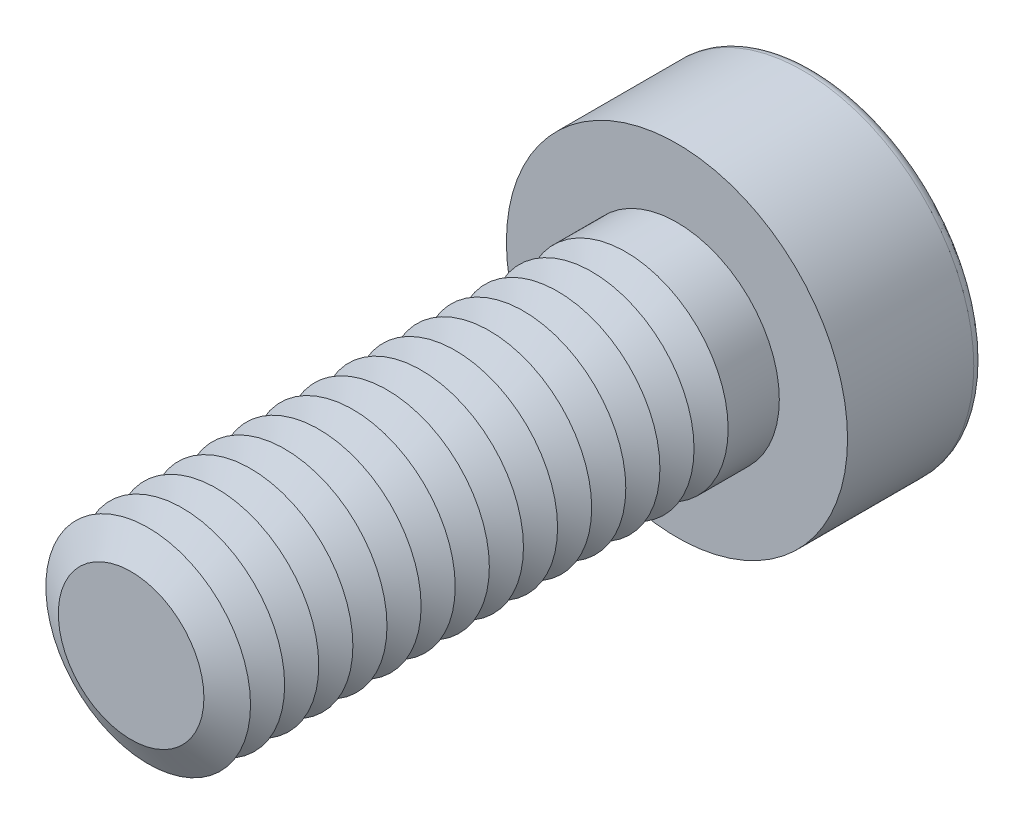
ISO-10303-21;
HEADER;
FILE_DESCRIPTION(('STEP AP214'),'2;1');
FILE_NAME('part.step','',(''),(''),'','','');
FILE_SCHEMA(('AUTOMOTIVE_DESIGN { 1 0 10303 214 1 1 1 1 }'));
ENDSEC;
DATA;
#1=APPLICATION_CONTEXT('core data for automotive mechanical design processes');
#2=APPLICATION_PROTOCOL_DEFINITION('international standard','automotive_design',2000,#1);
#3=PRODUCT_CONTEXT('',#1,'mechanical');
#4=PRODUCT('Part','Part','',(#3));
#5=PRODUCT_RELATED_PRODUCT_CATEGORY('part','',(#4));
#6=PRODUCT_DEFINITION_FORMATION('','',#4);
#7=PRODUCT_DEFINITION_CONTEXT('part definition',#1,'design');
#8=PRODUCT_DEFINITION('design','',#6,#7);
#9=PRODUCT_DEFINITION_SHAPE('','',#8);
#10=(LENGTH_UNIT() NAMED_UNIT(*) SI_UNIT(.MILLI.,.METRE.));
#11=(NAMED_UNIT(*) PLANE_ANGLE_UNIT() SI_UNIT($,.RADIAN.));
#12=(NAMED_UNIT(*) SI_UNIT($,.STERADIAN.) SOLID_ANGLE_UNIT());
#13=UNCERTAINTY_MEASURE_WITH_UNIT(LENGTH_MEASURE(1.E-05),#10,'distance_accuracy_value','');
#14=(GEOMETRIC_REPRESENTATION_CONTEXT(3) GLOBAL_UNCERTAINTY_ASSIGNED_CONTEXT((#13)) GLOBAL_UNIT_ASSIGNED_CONTEXT((#10,
#11,#12)) REPRESENTATION_CONTEXT('',''));
#15=CARTESIAN_POINT('',(0.,0.,0.));
#16=DIRECTION('',(0.,0.,1.));
#17=DIRECTION('',(1.,0.,0.));
#18=AXIS2_PLACEMENT_3D('',#15,#16,#17);
#19=CARTESIAN_POINT('',(0.,0.,12.5));
#20=DIRECTION('',(0.,0.,1.));
#21=DIRECTION('',(1.,0.,0.));
#22=AXIS2_PLACEMENT_3D('',#19,#20,#21);
#23=CONICAL_SURFACE('',#22,3.,1.0471975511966);
#24=CARTESIAN_POINT('',(0.,0.,12.));
#25=DIRECTION('',(0.,0.,1.));
#26=DIRECTION('',(1.,0.,0.));
#27=AXIS2_PLACEMENT_3D('',#24,#25,#26);
#28=CIRCLE('',#27,2.13397459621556);
#29=CARTESIAN_POINT('',(2.13397459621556,0.,12.));
#30=VERTEX_POINT('',#29);
#31=EDGE_CURVE('E313',#30,#30,#28,.T.);
#32=ORIENTED_EDGE('',*,*,#31,.T.);
#33=EDGE_LOOP('',(#32));
#34=FACE_BOUND('',#33,.T.);
#35=CARTESIAN_POINT('',(0.,0.,12.5));
#36=DIRECTION('',(0.,0.,1.));
#37=DIRECTION('',(1.,0.,0.));
#38=AXIS2_PLACEMENT_3D('',#35,#36,#37);
#39=CIRCLE('',#38,3.);
#40=CARTESIAN_POINT('',(3.,0.,12.5));
#41=VERTEX_POINT('',#40);
#42=EDGE_CURVE('E316',#41,#41,#39,.T.);
#43=ORIENTED_EDGE('',*,*,#42,.F.);
#44=EDGE_LOOP('',(#43));
#45=FACE_BOUND('',#44,.T.);
#46=ADVANCED_FACE('F39',(#34,#45),#23,.T.);
#47=CARTESIAN_POINT('',(0.,0.,12.));
#48=DIRECTION('',(0.,0.,-1.));
#49=DIRECTION('',(-1.,0.,0.));
#50=AXIS2_PLACEMENT_3D('',#47,#48,#49);
#51=CONICAL_SURFACE('',#50,2.13397459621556,1.0471975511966);
#52=CARTESIAN_POINT('',(0.,0.,11.5));
#53=DIRECTION('',(0.,0.,1.));
#54=DIRECTION('',(1.,0.,0.));
#55=AXIS2_PLACEMENT_3D('',#52,#53,#54);
#56=CIRCLE('',#55,3.);
#57=CARTESIAN_POINT('',(3.,0.,11.5));
#58=VERTEX_POINT('',#57);
#59=EDGE_CURVE('E323',#58,#58,#56,.T.);
#60=ORIENTED_EDGE('',*,*,#59,.T.);
#61=EDGE_LOOP('',(#60));
#62=FACE_BOUND('',#61,.T.);
#63=ORIENTED_EDGE('',*,*,#31,.F.);
#64=EDGE_LOOP('',(#63));
#65=FACE_BOUND('',#64,.T.);
#66=ADVANCED_FACE('F245',(#62,#65),#51,.T.);
#67=CARTESIAN_POINT('',(0.,0.,16.));
#68=DIRECTION('',(0.,0.,1.));
#69=DIRECTION('',(1.,0.,0.));
#70=AXIS2_PLACEMENT_3D('',#67,#68,#69);
#71=PLANE('',#70);
#72=CARTESIAN_POINT('',(0.,0.,16.));
#73=DIRECTION('',(0.,0.,1.));
#74=DIRECTION('',(1.,0.,0.));
#75=AXIS2_PLACEMENT_3D('',#72,#73,#74);
#76=CIRCLE('',#75,2.13397459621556);
#77=CARTESIAN_POINT('',(2.13397459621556,0.,16.));
#78=VERTEX_POINT('',#77);
#79=EDGE_CURVE('E174',#78,#78,#76,.T.);
#80=ORIENTED_EDGE('',*,*,#79,.T.);
#81=EDGE_LOOP('',(#80));
#82=FACE_BOUND('',#81,.T.);
#83=ADVANCED_FACE('F251',(#82),#71,.T.);
#84=CARTESIAN_POINT('',(0.,0.,16.));
#85=DIRECTION('',(0.,0.,-1.));
#86=DIRECTION('',(-1.,0.,0.));
#87=AXIS2_PLACEMENT_3D('',#84,#85,#86);
#88=CONICAL_SURFACE('',#87,2.13397459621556,1.0471975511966);
#89=CARTESIAN_POINT('',(0.,0.,15.5));
#90=DIRECTION('',(0.,0.,1.));
#91=DIRECTION('',(1.,0.,0.));
#92=AXIS2_PLACEMENT_3D('',#89,#90,#91);
#93=CIRCLE('',#92,3.);
#94=CARTESIAN_POINT('',(3.,0.,15.5));
#95=VERTEX_POINT('',#94);
#96=EDGE_CURVE('E291',#95,#95,#93,.T.);
#97=ORIENTED_EDGE('',*,*,#96,.T.);
#98=EDGE_LOOP('',(#97));
#99=FACE_BOUND('',#98,.T.);
#100=ORIENTED_EDGE('',*,*,#79,.F.);
#101=EDGE_LOOP('',(#100));
#102=FACE_BOUND('',#101,.T.);
#103=ADVANCED_FACE('F199',(#99,#102),#88,.T.);
#104=CARTESIAN_POINT('',(0.,0.,15.5));
#105=DIRECTION('',(0.,0.,1.));
#106=DIRECTION('',(1.,0.,0.));
#107=AXIS2_PLACEMENT_3D('',#104,#105,#106);
#108=CONICAL_SURFACE('',#107,3.,1.0471975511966);
#109=CARTESIAN_POINT('',(0.,0.,15.));
#110=DIRECTION('',(0.,0.,1.));
#111=DIRECTION('',(1.,0.,0.));
#112=AXIS2_PLACEMENT_3D('',#109,#110,#111);
#113=CIRCLE('',#112,2.13397459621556);
#114=CARTESIAN_POINT('',(2.13397459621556,0.,15.));
#115=VERTEX_POINT('',#114);
#116=EDGE_CURVE('E288',#115,#115,#113,.T.);
#117=ORIENTED_EDGE('',*,*,#116,.T.);
#118=EDGE_LOOP('',(#117));
#119=FACE_BOUND('',#118,.T.);
#120=ORIENTED_EDGE('',*,*,#96,.F.);
#121=EDGE_LOOP('',(#120));
#122=FACE_BOUND('',#121,.T.);
#123=ADVANCED_FACE('F277',(#119,#122),#108,.T.);
#124=CARTESIAN_POINT('',(0.,0.,15.));
#125=DIRECTION('',(0.,0.,-1.));
#126=DIRECTION('',(-1.,0.,0.));
#127=AXIS2_PLACEMENT_3D('',#124,#125,#126);
#128=CONICAL_SURFACE('',#127,2.13397459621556,1.0471975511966);
#129=CARTESIAN_POINT('',(0.,0.,14.5));
#130=DIRECTION('',(0.,0.,1.));
#131=DIRECTION('',(1.,0.,0.));
#132=AXIS2_PLACEMENT_3D('',#129,#130,#131);
#133=CIRCLE('',#132,3.);
#134=CARTESIAN_POINT('',(3.,0.,14.5));
#135=VERTEX_POINT('',#134);
#136=EDGE_CURVE('E299',#135,#135,#133,.T.);
#137=ORIENTED_EDGE('',*,*,#136,.T.);
#138=EDGE_LOOP('',(#137));
#139=FACE_BOUND('',#138,.T.);
#140=ORIENTED_EDGE('',*,*,#116,.F.);
#141=EDGE_LOOP('',(#140));
#142=FACE_BOUND('',#141,.T.);
#143=ADVANCED_FACE('F274',(#139,#142),#128,.T.);
#144=CARTESIAN_POINT('',(0.,0.,14.5));
#145=DIRECTION('',(0.,0.,1.));
#146=DIRECTION('',(1.,0.,0.));
#147=AXIS2_PLACEMENT_3D('',#144,#145,#146);
#148=CONICAL_SURFACE('',#147,3.,1.0471975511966);
#149=CARTESIAN_POINT('',(0.,0.,14.));
#150=DIRECTION('',(0.,0.,1.));
#151=DIRECTION('',(1.,0.,0.));
#152=AXIS2_PLACEMENT_3D('',#149,#150,#151);
#153=CIRCLE('',#152,2.13397459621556);
#154=CARTESIAN_POINT('',(2.13397459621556,0.,14.));
#155=VERTEX_POINT('',#154);
#156=EDGE_CURVE('E293',#155,#155,#153,.T.);
#157=ORIENTED_EDGE('',*,*,#156,.T.);
#158=EDGE_LOOP('',(#157));
#159=FACE_BOUND('',#158,.T.);
#160=ORIENTED_EDGE('',*,*,#136,.F.);
#161=EDGE_LOOP('',(#160));
#162=FACE_BOUND('',#161,.T.);
#163=ADVANCED_FACE('F270',(#159,#162),#148,.T.);
#164=CARTESIAN_POINT('',(0.,0.,14.));
#165=DIRECTION('',(0.,0.,-1.));
#166=DIRECTION('',(-1.,0.,0.));
#167=AXIS2_PLACEMENT_3D('',#164,#165,#166);
#168=CONICAL_SURFACE('',#167,2.13397459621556,1.0471975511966);
#169=CARTESIAN_POINT('',(0.,0.,13.5));
#170=DIRECTION('',(0.,0.,1.));
#171=DIRECTION('',(1.,0.,0.));
#172=AXIS2_PLACEMENT_3D('',#169,#170,#171);
#173=CIRCLE('',#172,3.);
#174=CARTESIAN_POINT('',(3.,0.,13.5));
#175=VERTEX_POINT('',#174);
#176=EDGE_CURVE('E309',#175,#175,#173,.T.);
#177=ORIENTED_EDGE('',*,*,#176,.T.);
#178=EDGE_LOOP('',(#177));
#179=FACE_BOUND('',#178,.T.);
#180=ORIENTED_EDGE('',*,*,#156,.F.);
#181=EDGE_LOOP('',(#180));
#182=FACE_BOUND('',#181,.T.);
#183=ADVANCED_FACE('F266',(#179,#182),#168,.T.);
#184=CARTESIAN_POINT('',(0.,0.,13.5));
#185=DIRECTION('',(0.,0.,1.));
#186=DIRECTION('',(1.,0.,0.));
#187=AXIS2_PLACEMENT_3D('',#184,#185,#186);
#188=CONICAL_SURFACE('',#187,3.,1.0471975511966);
#189=CARTESIAN_POINT('',(0.,0.,13.));
#190=DIRECTION('',(0.,0.,1.));
#191=DIRECTION('',(1.,0.,0.));
#192=AXIS2_PLACEMENT_3D('',#189,#190,#191);
#193=CIRCLE('',#192,2.13397459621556);
#194=CARTESIAN_POINT('',(2.13397459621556,0.,13.));
#195=VERTEX_POINT('',#194);
#196=EDGE_CURVE('E305',#195,#195,#193,.T.);
#197=ORIENTED_EDGE('',*,*,#196,.T.);
#198=EDGE_LOOP('',(#197));
#199=FACE_BOUND('',#198,.T.);
#200=ORIENTED_EDGE('',*,*,#176,.F.);
#201=EDGE_LOOP('',(#200));
#202=FACE_BOUND('',#201,.T.);
#203=ADVANCED_FACE('F262',(#199,#202),#188,.T.);
#204=CARTESIAN_POINT('',(0.,0.,13.));
#205=DIRECTION('',(0.,0.,-1.));
#206=DIRECTION('',(-1.,0.,0.));
#207=AXIS2_PLACEMENT_3D('',#204,#205,#206);
#208=CONICAL_SURFACE('',#207,2.13397459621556,1.0471975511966);
#209=ORIENTED_EDGE('',*,*,#42,.T.);
#210=EDGE_LOOP('',(#209));
#211=FACE_BOUND('',#210,.T.);
#212=ORIENTED_EDGE('',*,*,#196,.F.);
#213=EDGE_LOOP('',(#212));
#214=FACE_BOUND('',#213,.T.);
#215=ADVANCED_FACE('F258',(#211,#214),#208,.T.);
#216=CARTESIAN_POINT('',(0.,0.,11.5));
#217=DIRECTION('',(0.,0.,1.));
#218=DIRECTION('',(1.,0.,0.));
#219=AXIS2_PLACEMENT_3D('',#216,#217,#218);
#220=CONICAL_SURFACE('',#219,3.,1.0471975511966);
#221=CARTESIAN_POINT('',(0.,0.,11.));
#222=DIRECTION('',(0.,0.,1.));
#223=DIRECTION('',(1.,0.,0.));
#224=AXIS2_PLACEMENT_3D('',#221,#222,#223);
#225=CIRCLE('',#224,2.13397459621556);
#226=CARTESIAN_POINT('',(2.13397459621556,0.,11.));
#227=VERTEX_POINT('',#226);
#228=EDGE_CURVE('E319',#227,#227,#225,.T.);
#229=ORIENTED_EDGE('',*,*,#228,.T.);
#230=EDGE_LOOP('',(#229));
#231=FACE_BOUND('',#230,.T.);
#232=ORIENTED_EDGE('',*,*,#59,.F.);
#233=EDGE_LOOP('',(#232));
#234=FACE_BOUND('',#233,.T.);
#235=ADVANCED_FACE('F261',(#231,#234),#220,.T.);
#236=CARTESIAN_POINT('',(0.,0.,11.));
#237=DIRECTION('',(0.,0.,-1.));
#238=DIRECTION('',(-1.,0.,0.));
#239=AXIS2_PLACEMENT_3D('',#236,#237,#238);
#240=CONICAL_SURFACE('',#239,2.13397459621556,1.0471975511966);
#241=CARTESIAN_POINT('',(0.,0.,10.5));
#242=DIRECTION('',(0.,0.,1.));
#243=DIRECTION('',(1.,0.,0.));
#244=AXIS2_PLACEMENT_3D('',#241,#242,#243);
#245=CIRCLE('',#244,3.);
#246=CARTESIAN_POINT('',(3.,0.,10.5));
#247=VERTEX_POINT('',#246);
#248=EDGE_CURVE('E331',#247,#247,#245,.T.);
#249=ORIENTED_EDGE('',*,*,#248,.T.);
#250=EDGE_LOOP('',(#249));
#251=FACE_BOUND('',#250,.T.);
#252=ORIENTED_EDGE('',*,*,#228,.F.);
#253=EDGE_LOOP('',(#252));
#254=FACE_BOUND('',#253,.T.);
#255=ADVANCED_FACE('F477',(#251,#254),#240,.T.);
#256=CARTESIAN_POINT('',(0.,0.,10.5));
#257=DIRECTION('',(0.,0.,1.));
#258=DIRECTION('',(1.,0.,0.));
#259=AXIS2_PLACEMENT_3D('',#256,#257,#258);
#260=CONICAL_SURFACE('',#259,3.,1.0471975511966);
#261=CARTESIAN_POINT('',(0.,0.,10.));
#262=DIRECTION('',(0.,0.,1.));
#263=DIRECTION('',(1.,0.,0.));
#264=AXIS2_PLACEMENT_3D('',#261,#262,#263);
#265=CIRCLE('',#264,2.13397459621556);
#266=CARTESIAN_POINT('',(2.13397459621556,0.,10.));
#267=VERTEX_POINT('',#266);
#268=EDGE_CURVE('E327',#267,#267,#265,.T.);
#269=ORIENTED_EDGE('',*,*,#268,.T.);
#270=EDGE_LOOP('',(#269));
#271=FACE_BOUND('',#270,.T.);
#272=ORIENTED_EDGE('',*,*,#248,.F.);
#273=EDGE_LOOP('',(#272));
#274=FACE_BOUND('',#273,.T.);
#275=ADVANCED_FACE('F473',(#271,#274),#260,.T.);
#276=CARTESIAN_POINT('',(0.,0.,10.));
#277=DIRECTION('',(0.,0.,-1.));
#278=DIRECTION('',(-1.,0.,0.));
#279=AXIS2_PLACEMENT_3D('',#276,#277,#278);
#280=CONICAL_SURFACE('',#279,2.13397459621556,1.0471975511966);
#281=CARTESIAN_POINT('',(0.,0.,9.5));
#282=DIRECTION('',(0.,0.,1.));
#283=DIRECTION('',(1.,0.,0.));
#284=AXIS2_PLACEMENT_3D('',#281,#282,#283);
#285=CIRCLE('',#284,3.);
#286=CARTESIAN_POINT('',(3.,0.,9.5));
#287=VERTEX_POINT('',#286);
#288=EDGE_CURVE('E339',#287,#287,#285,.T.);
#289=ORIENTED_EDGE('',*,*,#288,.T.);
#290=EDGE_LOOP('',(#289));
#291=FACE_BOUND('',#290,.T.);
#292=ORIENTED_EDGE('',*,*,#268,.F.);
#293=EDGE_LOOP('',(#292));
#294=FACE_BOUND('',#293,.T.);
#295=ADVANCED_FACE('F469',(#291,#294),#280,.T.);
#296=CARTESIAN_POINT('',(0.,0.,9.5));
#297=DIRECTION('',(0.,0.,1.));
#298=DIRECTION('',(1.,0.,0.));
#299=AXIS2_PLACEMENT_3D('',#296,#297,#298);
#300=CONICAL_SURFACE('',#299,3.,1.0471975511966);
#301=CARTESIAN_POINT('',(0.,0.,9.));
#302=DIRECTION('',(0.,0.,1.));
#303=DIRECTION('',(1.,0.,0.));
#304=AXIS2_PLACEMENT_3D('',#301,#302,#303);
#305=CIRCLE('',#304,2.13397459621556);
#306=CARTESIAN_POINT('',(2.13397459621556,0.,9.));
#307=VERTEX_POINT('',#306);
#308=EDGE_CURVE('E335',#307,#307,#305,.T.);
#309=ORIENTED_EDGE('',*,*,#308,.T.);
#310=EDGE_LOOP('',(#309));
#311=FACE_BOUND('',#310,.T.);
#312=ORIENTED_EDGE('',*,*,#288,.F.);
#313=EDGE_LOOP('',(#312));
#314=FACE_BOUND('',#313,.T.);
#315=ADVANCED_FACE('F465',(#311,#314),#300,.T.);
#316=CARTESIAN_POINT('',(0.,0.,9.));
#317=DIRECTION('',(0.,0.,-1.));
#318=DIRECTION('',(-1.,0.,0.));
#319=AXIS2_PLACEMENT_3D('',#316,#317,#318);
#320=CONICAL_SURFACE('',#319,2.13397459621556,1.0471975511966);
#321=CARTESIAN_POINT('',(0.,0.,8.5));
#322=DIRECTION('',(0.,0.,1.));
#323=DIRECTION('',(1.,0.,0.));
#324=AXIS2_PLACEMENT_3D('',#321,#322,#323);
#325=CIRCLE('',#324,3.);
#326=CARTESIAN_POINT('',(3.,0.,8.5));
#327=VERTEX_POINT('',#326);
#328=EDGE_CURVE('E347',#327,#327,#325,.T.);
#329=ORIENTED_EDGE('',*,*,#328,.T.);
#330=EDGE_LOOP('',(#329));
#331=FACE_BOUND('',#330,.T.);
#332=ORIENTED_EDGE('',*,*,#308,.F.);
#333=EDGE_LOOP('',(#332));
#334=FACE_BOUND('',#333,.T.);
#335=ADVANCED_FACE('F461',(#331,#334),#320,.T.);
#336=CARTESIAN_POINT('',(0.,0.,8.5));
#337=DIRECTION('',(0.,0.,1.));
#338=DIRECTION('',(1.,0.,0.));
#339=AXIS2_PLACEMENT_3D('',#336,#337,#338);
#340=CONICAL_SURFACE('',#339,3.,1.0471975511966);
#341=CARTESIAN_POINT('',(0.,0.,8.));
#342=DIRECTION('',(0.,0.,1.));
#343=DIRECTION('',(1.,0.,0.));
#344=AXIS2_PLACEMENT_3D('',#341,#342,#343);
#345=CIRCLE('',#344,2.13397459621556);
#346=CARTESIAN_POINT('',(2.13397459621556,0.,8.));
#347=VERTEX_POINT('',#346);
#348=EDGE_CURVE('E343',#347,#347,#345,.T.);
#349=ORIENTED_EDGE('',*,*,#348,.T.);
#350=EDGE_LOOP('',(#349));
#351=FACE_BOUND('',#350,.T.);
#352=ORIENTED_EDGE('',*,*,#328,.F.);
#353=EDGE_LOOP('',(#352));
#354=FACE_BOUND('',#353,.T.);
#355=ADVANCED_FACE('F457',(#351,#354),#340,.T.);
#356=CARTESIAN_POINT('',(0.,0.,8.));
#357=DIRECTION('',(0.,0.,-1.));
#358=DIRECTION('',(-1.,0.,0.));
#359=AXIS2_PLACEMENT_3D('',#356,#357,#358);
#360=CONICAL_SURFACE('',#359,2.13397459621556,1.0471975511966);
#361=CARTESIAN_POINT('',(0.,0.,7.5));
#362=DIRECTION('',(0.,0.,1.));
#363=DIRECTION('',(1.,0.,0.));
#364=AXIS2_PLACEMENT_3D('',#361,#362,#363);
#365=CIRCLE('',#364,3.);
#366=CARTESIAN_POINT('',(3.,0.,7.5));
#367=VERTEX_POINT('',#366);
#368=EDGE_CURVE('E354',#367,#367,#365,.T.);
#369=ORIENTED_EDGE('',*,*,#368,.T.);
#370=EDGE_LOOP('',(#369));
#371=FACE_BOUND('',#370,.T.);
#372=ORIENTED_EDGE('',*,*,#348,.F.);
#373=EDGE_LOOP('',(#372));
#374=FACE_BOUND('',#373,.T.);
#375=ADVANCED_FACE('F453',(#371,#374),#360,.T.);
#376=CARTESIAN_POINT('',(0.,0.,7.5));
#377=DIRECTION('',(0.,0.,1.));
#378=DIRECTION('',(1.,0.,0.));
#379=AXIS2_PLACEMENT_3D('',#376,#377,#378);
#380=CONICAL_SURFACE('',#379,3.,1.0471975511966);
#381=CARTESIAN_POINT('',(0.,0.,7.));
#382=DIRECTION('',(0.,0.,1.));
#383=DIRECTION('',(1.,0.,0.));
#384=AXIS2_PLACEMENT_3D('',#381,#382,#383);
#385=CIRCLE('',#384,2.13397459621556);
#386=CARTESIAN_POINT('',(2.13397459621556,0.,7.));
#387=VERTEX_POINT('',#386);
#388=EDGE_CURVE('E350',#387,#387,#385,.T.);
#389=ORIENTED_EDGE('',*,*,#388,.T.);
#390=EDGE_LOOP('',(#389));
#391=FACE_BOUND('',#390,.T.);
#392=ORIENTED_EDGE('',*,*,#368,.F.);
#393=EDGE_LOOP('',(#392));
#394=FACE_BOUND('',#393,.T.);
#395=ADVANCED_FACE('F449',(#391,#394),#380,.T.);
#396=CARTESIAN_POINT('',(0.,0.,7.));
#397=DIRECTION('',(0.,0.,-1.));
#398=DIRECTION('',(-1.,0.,0.));
#399=AXIS2_PLACEMENT_3D('',#396,#397,#398);
#400=CONICAL_SURFACE('',#399,2.13397459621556,1.0471975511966);
#401=CARTESIAN_POINT('',(0.,0.,6.5));
#402=DIRECTION('',(0.,0.,1.));
#403=DIRECTION('',(1.,0.,0.));
#404=AXIS2_PLACEMENT_3D('',#401,#402,#403);
#405=CIRCLE('',#404,3.);
#406=CARTESIAN_POINT('',(3.,0.,6.5));
#407=VERTEX_POINT('',#406);
#408=EDGE_CURVE('E362',#407,#407,#405,.T.);
#409=ORIENTED_EDGE('',*,*,#408,.T.);
#410=EDGE_LOOP('',(#409));
#411=FACE_BOUND('',#410,.T.);
#412=ORIENTED_EDGE('',*,*,#388,.F.);
#413=EDGE_LOOP('',(#412));
#414=FACE_BOUND('',#413,.T.);
#415=ADVANCED_FACE('F445',(#411,#414),#400,.T.);
#416=CARTESIAN_POINT('',(0.,0.,6.5));
#417=DIRECTION('',(0.,0.,1.));
#418=DIRECTION('',(1.,0.,0.));
#419=AXIS2_PLACEMENT_3D('',#416,#417,#418);
#420=CONICAL_SURFACE('',#419,3.,1.0471975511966);
#421=CARTESIAN_POINT('',(0.,0.,6.));
#422=DIRECTION('',(0.,0.,1.));
#423=DIRECTION('',(1.,0.,0.));
#424=AXIS2_PLACEMENT_3D('',#421,#422,#423);
#425=CIRCLE('',#424,2.13397459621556);
#426=CARTESIAN_POINT('',(2.13397459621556,0.,6.));
#427=VERTEX_POINT('',#426);
#428=EDGE_CURVE('E358',#427,#427,#425,.T.);
#429=ORIENTED_EDGE('',*,*,#428,.T.);
#430=EDGE_LOOP('',(#429));
#431=FACE_BOUND('',#430,.T.);
#432=ORIENTED_EDGE('',*,*,#408,.F.);
#433=EDGE_LOOP('',(#432));
#434=FACE_BOUND('',#433,.T.);
#435=ADVANCED_FACE('F441',(#431,#434),#420,.T.);
#436=CARTESIAN_POINT('',(0.,0.,6.));
#437=DIRECTION('',(0.,0.,-1.));
#438=DIRECTION('',(-1.,0.,0.));
#439=AXIS2_PLACEMENT_3D('',#436,#437,#438);
#440=CONICAL_SURFACE('',#439,2.13397459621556,1.0471975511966);
#441=CARTESIAN_POINT('',(0.,0.,5.5));
#442=DIRECTION('',(0.,0.,1.));
#443=DIRECTION('',(1.,0.,0.));
#444=AXIS2_PLACEMENT_3D('',#441,#442,#443);
#445=CIRCLE('',#444,3.);
#446=CARTESIAN_POINT('',(3.,0.,5.5));
#447=VERTEX_POINT('',#446);
#448=EDGE_CURVE('E370',#447,#447,#445,.T.);
#449=ORIENTED_EDGE('',*,*,#448,.T.);
#450=EDGE_LOOP('',(#449));
#451=FACE_BOUND('',#450,.T.);
#452=ORIENTED_EDGE('',*,*,#428,.F.);
#453=EDGE_LOOP('',(#452));
#454=FACE_BOUND('',#453,.T.);
#455=ADVANCED_FACE('F437',(#451,#454),#440,.T.);
#456=CARTESIAN_POINT('',(0.,0.,5.5));
#457=DIRECTION('',(0.,0.,1.));
#458=DIRECTION('',(1.,0.,0.));
#459=AXIS2_PLACEMENT_3D('',#456,#457,#458);
#460=CONICAL_SURFACE('',#459,3.,1.0471975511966);
#461=CARTESIAN_POINT('',(0.,0.,5.));
#462=DIRECTION('',(0.,0.,1.));
#463=DIRECTION('',(1.,0.,0.));
#464=AXIS2_PLACEMENT_3D('',#461,#462,#463);
#465=CIRCLE('',#464,2.13397459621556);
#466=CARTESIAN_POINT('',(2.13397459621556,0.,5.));
#467=VERTEX_POINT('',#466);
#468=EDGE_CURVE('E366',#467,#467,#465,.T.);
#469=ORIENTED_EDGE('',*,*,#468,.T.);
#470=EDGE_LOOP('',(#469));
#471=FACE_BOUND('',#470,.T.);
#472=ORIENTED_EDGE('',*,*,#448,.F.);
#473=EDGE_LOOP('',(#472));
#474=FACE_BOUND('',#473,.T.);
#475=ADVANCED_FACE('F433',(#471,#474),#460,.T.);
#476=CARTESIAN_POINT('',(0.,0.,5.));
#477=DIRECTION('',(0.,0.,-1.));
#478=DIRECTION('',(-1.,0.,0.));
#479=AXIS2_PLACEMENT_3D('',#476,#477,#478);
#480=CONICAL_SURFACE('',#479,2.13397459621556,1.0471975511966);
#481=CARTESIAN_POINT('',(0.,0.,4.5));
#482=DIRECTION('',(0.,0.,1.));
#483=DIRECTION('',(1.,0.,0.));
#484=AXIS2_PLACEMENT_3D('',#481,#482,#483);
#485=CIRCLE('',#484,3.);
#486=CARTESIAN_POINT('',(3.,0.,4.5));
#487=VERTEX_POINT('',#486);
#488=EDGE_CURVE('E378',#487,#487,#485,.T.);
#489=ORIENTED_EDGE('',*,*,#488,.T.);
#490=EDGE_LOOP('',(#489));
#491=FACE_BOUND('',#490,.T.);
#492=ORIENTED_EDGE('',*,*,#468,.F.);
#493=EDGE_LOOP('',(#492));
#494=FACE_BOUND('',#493,.T.);
#495=ADVANCED_FACE('F429',(#491,#494),#480,.T.);
#496=CARTESIAN_POINT('',(0.,0.,4.5));
#497=DIRECTION('',(0.,0.,1.));
#498=DIRECTION('',(1.,0.,0.));
#499=AXIS2_PLACEMENT_3D('',#496,#497,#498);
#500=CONICAL_SURFACE('',#499,3.,1.0471975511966);
#501=CARTESIAN_POINT('',(0.,0.,4.));
#502=DIRECTION('',(0.,0.,1.));
#503=DIRECTION('',(1.,0.,0.));
#504=AXIS2_PLACEMENT_3D('',#501,#502,#503);
#505=CIRCLE('',#504,2.13397459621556);
#506=CARTESIAN_POINT('',(2.13397459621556,0.,4.));
#507=VERTEX_POINT('',#506);
#508=EDGE_CURVE('E374',#507,#507,#505,.T.);
#509=ORIENTED_EDGE('',*,*,#508,.T.);
#510=EDGE_LOOP('',(#509));
#511=FACE_BOUND('',#510,.T.);
#512=ORIENTED_EDGE('',*,*,#488,.F.);
#513=EDGE_LOOP('',(#512));
#514=FACE_BOUND('',#513,.T.);
#515=ADVANCED_FACE('F425',(#511,#514),#500,.T.);
#516=CARTESIAN_POINT('',(0.,0.,4.));
#517=DIRECTION('',(0.,0.,-1.));
#518=DIRECTION('',(-1.,0.,0.));
#519=AXIS2_PLACEMENT_3D('',#516,#517,#518);
#520=CONICAL_SURFACE('',#519,2.13397459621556,1.0471975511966);
#521=CARTESIAN_POINT('',(0.,0.,3.5));
#522=DIRECTION('',(0.,0.,1.));
#523=DIRECTION('',(1.,0.,0.));
#524=AXIS2_PLACEMENT_3D('',#521,#522,#523);
#525=CIRCLE('',#524,3.);
#526=CARTESIAN_POINT('',(3.,0.,3.5));
#527=VERTEX_POINT('',#526);
#528=EDGE_CURVE('E386',#527,#527,#525,.T.);
#529=ORIENTED_EDGE('',*,*,#528,.T.);
#530=EDGE_LOOP('',(#529));
#531=FACE_BOUND('',#530,.T.);
#532=ORIENTED_EDGE('',*,*,#508,.F.);
#533=EDGE_LOOP('',(#532));
#534=FACE_BOUND('',#533,.T.);
#535=ADVANCED_FACE('F421',(#531,#534),#520,.T.);
#536=CARTESIAN_POINT('',(0.,0.,3.5));
#537=DIRECTION('',(0.,0.,1.));
#538=DIRECTION('',(1.,0.,0.));
#539=AXIS2_PLACEMENT_3D('',#536,#537,#538);
#540=CONICAL_SURFACE('',#539,3.,1.0471975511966);
#541=CARTESIAN_POINT('',(0.,0.,3.));
#542=DIRECTION('',(0.,0.,1.));
#543=DIRECTION('',(1.,0.,0.));
#544=AXIS2_PLACEMENT_3D('',#541,#542,#543);
#545=CIRCLE('',#544,2.13397459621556);
#546=CARTESIAN_POINT('',(2.13397459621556,0.,3.));
#547=VERTEX_POINT('',#546);
#548=EDGE_CURVE('E382',#547,#547,#545,.T.);
#549=ORIENTED_EDGE('',*,*,#548,.T.);
#550=EDGE_LOOP('',(#549));
#551=FACE_BOUND('',#550,.T.);
#552=ORIENTED_EDGE('',*,*,#528,.F.);
#553=EDGE_LOOP('',(#552));
#554=FACE_BOUND('',#553,.T.);
#555=ADVANCED_FACE('F416',(#551,#554),#540,.T.);
#556=CARTESIAN_POINT('',(0.,0.,3.));
#557=DIRECTION('',(0.,0.,-1.));
#558=DIRECTION('',(-1.,0.,0.));
#559=AXIS2_PLACEMENT_3D('',#556,#557,#558);
#560=CONICAL_SURFACE('',#559,2.13397459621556,1.0471975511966);
#561=CARTESIAN_POINT('',(0.,0.,2.5));
#562=DIRECTION('',(0.,0.,1.));
#563=DIRECTION('',(1.,0.,0.));
#564=AXIS2_PLACEMENT_3D('',#561,#562,#563);
#565=CIRCLE('',#564,3.);
#566=CARTESIAN_POINT('',(3.,0.,2.5));
#567=VERTEX_POINT('',#566);
#568=EDGE_CURVE('E397',#567,#567,#565,.T.);
#569=ORIENTED_EDGE('',*,*,#568,.T.);
#570=EDGE_LOOP('',(#569));
#571=FACE_BOUND('',#570,.T.);
#572=ORIENTED_EDGE('',*,*,#548,.F.);
#573=EDGE_LOOP('',(#572));
#574=FACE_BOUND('',#573,.T.);
#575=ADVANCED_FACE('F402',(#571,#574),#560,.T.);
#576=CARTESIAN_POINT('',(0.,0.,2.5));
#577=DIRECTION('',(0.,0.,1.));
#578=DIRECTION('',(1.,0.,0.));
#579=AXIS2_PLACEMENT_3D('',#576,#577,#578);
#580=CONICAL_SURFACE('',#579,3.,1.0471975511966);
#581=CARTESIAN_POINT('',(0.,0.,2.));
#582=DIRECTION('',(0.,0.,1.));
#583=DIRECTION('',(1.,0.,0.));
#584=AXIS2_PLACEMENT_3D('',#581,#582,#583);
#585=CIRCLE('',#584,2.13397459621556);
#586=CARTESIAN_POINT('',(2.13397459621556,0.,2.));
#587=VERTEX_POINT('',#586);
#588=EDGE_CURVE('E390',#587,#587,#585,.T.);
#589=ORIENTED_EDGE('',*,*,#588,.T.);
#590=EDGE_LOOP('',(#589));
#591=FACE_BOUND('',#590,.T.);
#592=ORIENTED_EDGE('',*,*,#568,.F.);
#593=EDGE_LOOP('',(#592));
#594=FACE_BOUND('',#593,.T.);
#595=ADVANCED_FACE('F405',(#591,#594),#580,.T.);
#596=CARTESIAN_POINT('',(0.,0.,2.));
#597=DIRECTION('',(0.,0.,-1.));
#598=DIRECTION('',(-1.,0.,0.));
#599=AXIS2_PLACEMENT_3D('',#596,#597,#598);
#600=CONICAL_SURFACE('',#599,2.13397459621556,1.0471975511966);
#601=CARTESIAN_POINT('',(0.,0.,1.5));
#602=DIRECTION('',(0.,0.,1.));
#603=DIRECTION('',(1.,0.,0.));
#604=AXIS2_PLACEMENT_3D('',#601,#602,#603);
#605=CIRCLE('',#604,3.);
#606=CARTESIAN_POINT('',(3.,0.,1.5));
#607=VERTEX_POINT('',#606);
#608=EDGE_CURVE('E393',#607,#607,#605,.T.);
#609=ORIENTED_EDGE('',*,*,#608,.T.);
#610=EDGE_LOOP('',(#609));
#611=FACE_BOUND('',#610,.T.);
#612=ORIENTED_EDGE('',*,*,#588,.F.);
#613=EDGE_LOOP('',(#612));
#614=FACE_BOUND('',#613,.T.);
#615=ADVANCED_FACE('F407',(#611,#614),#600,.T.);
#616=CARTESIAN_POINT('',(0.,0.,-1.));
#617=DIRECTION('',(0.,0.,-1.));
#618=DIRECTION('',(-1.,0.,0.));
#619=AXIS2_PLACEMENT_3D('',#616,#617,#618);
#620=CONICAL_SURFACE('',#619,2.,1.0471975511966);
#621=CARTESIAN_POINT('',(0.,0.,0.154700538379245));
#622=VERTEX_POINT('',#621);
#623=VERTEX_LOOP('',#622);
#624=FACE_BOUND('',#623,.T.);
#625=CARTESIAN_POINT('',(0.,0.,-1.));
#626=DIRECTION('',(0.,0.,-1.));
#627=DIRECTION('',(-1.,0.,0.));
#628=AXIS2_PLACEMENT_3D('',#625,#626,#627);
#629=CIRCLE('',#628,2.);
#630=CARTESIAN_POINT('',(-1.73205080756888,0.999999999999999,-1.));
#631=VERTEX_POINT('',#630);
#632=CARTESIAN_POINT('',(0.,2.,-1.));
#633=VERTEX_POINT('',#632);
#634=EDGE_CURVE('E149',#631,#633,#629,.T.);
#635=ORIENTED_EDGE('',*,*,#634,.T.);
#636=CARTESIAN_POINT('',(0.,0.,-1.));
#637=DIRECTION('',(0.,0.,-1.));
#638=DIRECTION('',(-1.,0.,0.));
#639=AXIS2_PLACEMENT_3D('',#636,#637,#638);
#640=CIRCLE('',#639,2.);
#641=CARTESIAN_POINT('',(1.73205080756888,1.,-1.));
#642=VERTEX_POINT('',#641);
#643=EDGE_CURVE('E54',#633,#642,#640,.T.);
#644=ORIENTED_EDGE('',*,*,#643,.T.);
#645=CARTESIAN_POINT('',(1.73205080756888,-0.999999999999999,-1.));
#646=VERTEX_POINT('',#645);
#647=EDGE_CURVE('E964',#642,#646,#640,.T.);
#648=ORIENTED_EDGE('',*,*,#647,.T.);
#649=CARTESIAN_POINT('',(0.,-2.,-1.));
#650=VERTEX_POINT('',#649);
#651=EDGE_CURVE('E962',#646,#650,#640,.T.);
#652=ORIENTED_EDGE('',*,*,#651,.T.);
#653=CARTESIAN_POINT('',(-1.73205080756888,-0.999999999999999,-1.));
#654=VERTEX_POINT('',#653);
#655=EDGE_CURVE('E957',#650,#654,#640,.T.);
#656=ORIENTED_EDGE('',*,*,#655,.T.);
#657=EDGE_CURVE('E955',#654,#631,#640,.T.);
#658=ORIENTED_EDGE('',*,*,#657,.T.);
#659=EDGE_LOOP('',(#635,#644,#648,#652,#656,#658));
#660=FACE_BOUND('',#659,.T.);
#661=ADVANCED_FACE('F201',(#624,#660),#620,.F.);
#662=CARTESIAN_POINT('',(0.,0.,-1.));
#663=DIRECTION('',(0.,0.,-1.));
#664=DIRECTION('',(-1.,0.,0.));
#665=AXIS2_PLACEMENT_3D('',#662,#663,#664);
#666=PLANE('',#665);
#667=ORIENTED_EDGE('',*,*,#643,.F.);
#668=DIRECTION('',(1.,0.,0.));
#669=VECTOR('',#668,1.);
#670=CARTESIAN_POINT('',(-1.15470053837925,2.,-1.));
#671=LINE('',#670,#669);
#672=CARTESIAN_POINT('',(1.15470053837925,2.,-1.));
#673=VERTEX_POINT('',#672);
#674=EDGE_CURVE('E1001',#633,#673,#671,.T.);
#675=ORIENTED_EDGE('',*,*,#674,.T.);
#676=DIRECTION('',(0.5,-0.866025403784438,0.));
#677=VECTOR('',#676,1.);
#678=CARTESIAN_POINT('',(1.15470053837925,2.,-1.));
#679=LINE('',#678,#677);
#680=EDGE_CURVE('E155',#673,#642,#679,.T.);
#681=ORIENTED_EDGE('',*,*,#680,.T.);
#682=EDGE_LOOP('',(#667,#675,#681));
#683=FACE_BOUND('',#682,.T.);
#684=ADVANCED_FACE('F560',(#683),#666,.T.);
#685=ORIENTED_EDGE('',*,*,#647,.F.);
#686=CARTESIAN_POINT('',(2.3094010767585,0.,-1.));
#687=VERTEX_POINT('',#686);
#688=EDGE_CURVE('E1007',#642,#687,#679,.T.);
#689=ORIENTED_EDGE('',*,*,#688,.T.);
#690=DIRECTION('',(-0.5,-0.866025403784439,0.));
#691=VECTOR('',#690,1.);
#692=CARTESIAN_POINT('',(2.3094010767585,0.,-1.));
#693=LINE('',#692,#691);
#694=EDGE_CURVE('E976',#687,#646,#693,.T.);
#695=ORIENTED_EDGE('',*,*,#694,.T.);
#696=EDGE_LOOP('',(#685,#689,#695));
#697=FACE_BOUND('',#696,.T.);
#698=ADVANCED_FACE('F570',(#697),#666,.T.);
#699=ORIENTED_EDGE('',*,*,#651,.F.);
#700=CARTESIAN_POINT('',(1.15470053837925,-2.,-1.));
#701=VERTEX_POINT('',#700);
#702=EDGE_CURVE('E978',#646,#701,#693,.T.);
#703=ORIENTED_EDGE('',*,*,#702,.T.);
#704=DIRECTION('',(-1.,0.,0.));
#705=VECTOR('',#704,1.);
#706=CARTESIAN_POINT('',(1.15470053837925,-2.,-1.));
#707=LINE('',#706,#705);
#708=EDGE_CURVE('E929',#701,#650,#707,.T.);
#709=ORIENTED_EDGE('',*,*,#708,.T.);
#710=EDGE_LOOP('',(#699,#703,#709));
#711=FACE_BOUND('',#710,.T.);
#712=ADVANCED_FACE('F580',(#711),#666,.T.);
#713=ORIENTED_EDGE('',*,*,#655,.F.);
#714=CARTESIAN_POINT('',(-1.15470053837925,-2.,-1.));
#715=VERTEX_POINT('',#714);
#716=EDGE_CURVE('E972',#650,#715,#707,.T.);
#717=ORIENTED_EDGE('',*,*,#716,.T.);
#718=DIRECTION('',(-0.5,0.866025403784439,0.));
#719=VECTOR('',#718,1.);
#720=CARTESIAN_POINT('',(-1.15470053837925,-2.,-1.));
#721=LINE('',#720,#719);
#722=EDGE_CURVE('E974',#715,#654,#721,.T.);
#723=ORIENTED_EDGE('',*,*,#722,.T.);
#724=EDGE_LOOP('',(#713,#717,#723));
#725=FACE_BOUND('',#724,.T.);
#726=ADVANCED_FACE('F588',(#725),#666,.T.);
#727=ORIENTED_EDGE('',*,*,#657,.F.);
#728=CARTESIAN_POINT('',(-2.3094010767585,0.,-1.));
#729=VERTEX_POINT('',#728);
#730=EDGE_CURVE('E980',#654,#729,#721,.T.);
#731=ORIENTED_EDGE('',*,*,#730,.T.);
#732=DIRECTION('',(0.5,0.866025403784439,0.));
#733=VECTOR('',#732,1.);
#734=CARTESIAN_POINT('',(-2.3094010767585,0.,-1.));
#735=LINE('',#734,#733);
#736=EDGE_CURVE('E158',#729,#631,#735,.T.);
#737=ORIENTED_EDGE('',*,*,#736,.T.);
#738=EDGE_LOOP('',(#727,#731,#737));
#739=FACE_BOUND('',#738,.T.);
#740=ADVANCED_FACE('F231',(#739),#666,.T.);
#741=ORIENTED_EDGE('',*,*,#634,.F.);
#742=CARTESIAN_POINT('',(-1.15470053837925,2.,-1.));
#743=VERTEX_POINT('',#742);
#744=EDGE_CURVE('E987',#631,#743,#735,.T.);
#745=ORIENTED_EDGE('',*,*,#744,.T.);
#746=EDGE_CURVE('E1002',#743,#633,#671,.T.);
#747=ORIENTED_EDGE('',*,*,#746,.T.);
#748=EDGE_LOOP('',(#741,#745,#747));
#749=FACE_BOUND('',#748,.T.);
#750=ADVANCED_FACE('F572',(#749),#666,.T.);
#751=CARTESIAN_POINT('',(-1.15470053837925,2.,-1.));
#752=DIRECTION('',(0.,1.,0.));
#753=DIRECTION('',(0.,0.,1.));
#754=AXIS2_PLACEMENT_3D('',#751,#752,#753);
#755=PLANE('',#754);
#756=DIRECTION('',(0.,0.,-1.));
#757=VECTOR('',#756,1.);
#758=CARTESIAN_POINT('',(-1.15470053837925,2.,-1.));
#759=LINE('',#758,#757);
#760=CARTESIAN_POINT('',(-1.15470053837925,2.,-4.));
#761=VERTEX_POINT('',#760);
#762=EDGE_CURVE('E147',#743,#761,#759,.T.);
#763=ORIENTED_EDGE('',*,*,#762,.T.);
#764=CARTESIAN_POINT('',(-3.01440758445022,2.,-4.35051689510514));
#765=CARTESIAN_POINT('',(-2.92409762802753,2.,-4.33035636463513));
#766=CARTESIAN_POINT('',(-2.83373054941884,2.,-4.31045254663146));
#767=CARTESIAN_POINT('',(-2.65285291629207,2.,-4.27128852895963));
#768=CARTESIAN_POINT('',(-2.562342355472,2.,-4.25202835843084));
#769=CARTESIAN_POINT('',(-2.29037985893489,2.,-4.19537300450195));
#770=CARTESIAN_POINT('',(-2.10868043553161,2.,-4.15914446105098));
#771=CARTESIAN_POINT('',(-1.74597297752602,2.,-4.09171688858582));
#772=CARTESIAN_POINT('',(-1.56497266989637,2.,-4.06047686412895));
#773=CARTESIAN_POINT('',(-1.20186568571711,2.,-4.00513826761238));
#774=CARTESIAN_POINT('',(-1.01975924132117,2.,-3.98103824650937));
#775=CARTESIAN_POINT('',(-0.744747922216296,2.,-3.9525901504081));
#776=CARTESIAN_POINT('',(-0.652245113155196,2.,-3.9443671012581));
#777=CARTESIAN_POINT('',(-0.467020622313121,2.,-3.93099406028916));
#778=CARTESIAN_POINT('',(-0.374298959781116,2.,-3.92584380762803));
#779=CARTESIAN_POINT('',(-0.188764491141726,2.,-3.91891540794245));
#780=CARTESIAN_POINT('',(-0.0959517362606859,2.,-3.91713591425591));
#781=CARTESIAN_POINT('',(0.0896753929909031,2.,-3.91705786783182));
#782=CARTESIAN_POINT('',(0.182489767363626,2.,-3.91875932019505));
#783=CARTESIAN_POINT('',(0.368369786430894,2.,-3.92554892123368));
#784=CARTESIAN_POINT('',(0.461434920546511,2.,-3.93065079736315));
#785=CARTESIAN_POINT('',(0.647346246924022,2.,-3.94395663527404));
#786=CARTESIAN_POINT('',(0.740192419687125,2.,-3.95216086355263));
#787=CARTESIAN_POINT('',(1.01841374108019,2.,-3.98081777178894));
#788=CARTESIAN_POINT('',(1.2033713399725,2.,-4.00531018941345));
#789=CARTESIAN_POINT('',(1.57694396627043,2.,-4.06236202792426));
#790=CARTESIAN_POINT('',(1.76552771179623,2.,-4.09511615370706));
#791=CARTESIAN_POINT('',(2.14178491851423,2.,-4.1655706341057));
#792=CARTESIAN_POINT('',(2.32945822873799,2.,-4.20327178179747));
#793=CARTESIAN_POINT('',(2.70417911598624,2.,-4.28188312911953));
#794=CARTESIAN_POINT('',(2.89122649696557,2.,-4.32279425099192));
#795=CARTESIAN_POINT('',(3.26484478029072,2.,-4.40674298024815));
#796=CARTESIAN_POINT('',(3.45141567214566,2.,-4.44978063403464));
#797=CARTESIAN_POINT('',(3.821938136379,2.,-4.53678178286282));
#798=CARTESIAN_POINT('',(4.00589388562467,2.,-4.58072756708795));
#799=CARTESIAN_POINT('',(4.37356350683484,2.,-4.66963526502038));
#800=CARTESIAN_POINT('',(4.55727737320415,2.,-4.71459720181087));
#801=CARTESIAN_POINT('',(4.9242660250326,2.,-4.80519833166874));
#802=CARTESIAN_POINT('',(5.10754106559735,2.,-4.85083649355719));
#803=CARTESIAN_POINT('',(5.47394280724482,2.,-4.94267693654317));
#804=CARTESIAN_POINT('',(5.65706951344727,2.,-4.98887919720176));
#805=CARTESIAN_POINT('',(5.84014583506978,2.,-5.03527803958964));
#806=B_SPLINE_CURVE_WITH_KNOTS('',3,(#764,#765,#766,#767,#768,#769,#770,#771,#772,#773,#774,
#775,#776,#777,#778,#779,#780,#781,#782,#783,#784,#785,#786,#787,#788,#789,#790,#791,#792,#793,
#794,#795,#796,#797,#798,#799,#800,#801,#802,#803,#804,#805),.UNSPECIFIED.,.F.,.F.,(4,2,2,2,2,2,
2,2,2,2,2,2,2,2,2,2,2,2,2,2,4),(0.,0.277597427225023,0.555207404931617,1.11099118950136,
1.66194208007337,2.21278108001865,2.49134108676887,2.76987744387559,3.04830249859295,
3.32672796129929,3.60628428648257,3.88586463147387,4.44532615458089,5.0194589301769,
5.59368385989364,6.16807437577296,6.74247743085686,7.30986991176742,7.87727529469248,
8.44388991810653,9.01048407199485),.UNSPECIFIED.);
#807=CARTESIAN_POINT('',(1.15470053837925,2.,-4.));
#808=VERTEX_POINT('',#807);
#809=EDGE_CURVE('E124',#761,#808,#806,.T.);
#810=ORIENTED_EDGE('',*,*,#809,.T.);
#811=DIRECTION('',(0.,0.,-1.));
#812=VECTOR('',#811,1.);
#813=CARTESIAN_POINT('',(1.15470053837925,2.,-1.));
#814=LINE('',#813,#812);
#815=EDGE_CURVE('E143',#673,#808,#814,.T.);
#816=ORIENTED_EDGE('',*,*,#815,.F.);
#817=ORIENTED_EDGE('',*,*,#674,.F.);
#818=ORIENTED_EDGE('',*,*,#746,.F.);
#819=EDGE_LOOP('',(#763,#810,#816,#817,#818));
#820=FACE_BOUND('',#819,.T.);
#821=ADVANCED_FACE('F141',(#820),#755,.F.);
#822=CARTESIAN_POINT('',(1.15470053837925,2.,-1.));
#823=DIRECTION('',(0.866025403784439,0.5,0.));
#824=DIRECTION('',(-0.5,0.866025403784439,0.));
#825=AXIS2_PLACEMENT_3D('',#822,#823,#824);
#826=PLANE('',#825);
#827=ORIENTED_EDGE('',*,*,#815,.T.);
#828=CARTESIAN_POINT('',(1.15458506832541,2.0002,-4.00003094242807));
#829=CARTESIAN_POINT('',(1.20254643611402,1.91712847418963,-3.98717294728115));
#830=CARTESIAN_POINT('',(1.25059477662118,1.83390630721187,-3.97549990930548));
#831=CARTESIAN_POINT('',(1.3468611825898,1.66716800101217,-3.95499135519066));
#832=CARTESIAN_POINT('',(1.39507930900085,1.58365175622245,-3.94615699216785));
#833=CARTESIAN_POINT('',(1.49139287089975,1.41683177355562,-3.93184164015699));
#834=CARTESIAN_POINT('',(1.53948765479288,1.33352916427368,-3.92634357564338));
#835=CARTESIAN_POINT('',(1.63573857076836,1.1668176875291,-3.91897122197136));
#836=CARTESIAN_POINT('',(1.68389468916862,1.08340884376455,-3.91709623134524));
#837=CARTESIAN_POINT('',(1.78020692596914,0.916591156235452,-3.91709623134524));
#838=CARTESIAN_POINT('',(1.82836304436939,0.833182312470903,-3.91897122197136));
#839=CARTESIAN_POINT('',(1.92461396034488,0.666470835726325,-3.92634357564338));
#840=CARTESIAN_POINT('',(1.972708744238,0.583168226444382,-3.93184164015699));
#841=CARTESIAN_POINT('',(2.06902230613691,0.416348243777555,-3.94615699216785));
#842=CARTESIAN_POINT('',(2.11724043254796,0.332831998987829,-3.95499135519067));
#843=CARTESIAN_POINT('',(2.21350683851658,0.16609369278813,-3.97549990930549));
#844=CARTESIAN_POINT('',(2.26155517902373,0.0828715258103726,-3.98717294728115));
#845=CARTESIAN_POINT('',(2.30951654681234,-0.000199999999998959,-4.00003094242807));
#846=B_SPLINE_CURVE_WITH_KNOTS('',3,(#828,#829,#830,#831,#832,#833,#834,#835,#836,#837,#838,
#839,#840,#841,#842,#843,#844,#845),.UNSPECIFIED.,.F.,.F.,(4,2,2,2,2,2,2,2,4),(0.,
0.29035724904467,0.580832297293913,0.869807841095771,1.15872743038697,1.44764701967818,
1.73662256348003,2.02709761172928,2.31745486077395),.UNSPECIFIED.);
#847=CARTESIAN_POINT('',(2.3094010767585,0.,-4.));
#848=VERTEX_POINT('',#847);
#849=EDGE_CURVE('E11',#808,#848,#846,.T.);
#850=ORIENTED_EDGE('',*,*,#849,.T.);
#851=DIRECTION('',(0.,0.,-1.));
#852=VECTOR('',#851,1.);
#853=CARTESIAN_POINT('',(2.3094010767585,0.,-1.));
#854=LINE('',#853,#852);
#855=EDGE_CURVE('E157',#687,#848,#854,.T.);
#856=ORIENTED_EDGE('',*,*,#855,.F.);
#857=ORIENTED_EDGE('',*,*,#688,.F.);
#858=ORIENTED_EDGE('',*,*,#680,.F.);
#859=EDGE_LOOP('',(#827,#850,#856,#857,#858));
#860=FACE_BOUND('',#859,.T.);
#861=ADVANCED_FACE('F152',(#860),#826,.F.);
#862=CARTESIAN_POINT('',(2.3094010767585,0.,-1.));
#863=DIRECTION('',(0.866025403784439,-0.5,0.));
#864=DIRECTION('',(0.5,0.866025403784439,0.));
#865=AXIS2_PLACEMENT_3D('',#862,#863,#864);
#866=PLANE('',#865);
#867=ORIENTED_EDGE('',*,*,#855,.T.);
#868=CARTESIAN_POINT('',(2.30951654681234,0.000200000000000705,-4.00003094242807));
#869=CARTESIAN_POINT('',(2.26155517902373,-0.0828715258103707,-3.98717294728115));
#870=CARTESIAN_POINT('',(2.21350683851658,-0.166093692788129,-3.97549990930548));
#871=CARTESIAN_POINT('',(2.11724043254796,-0.332831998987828,-3.95499135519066));
#872=CARTESIAN_POINT('',(2.06902230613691,-0.416348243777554,-3.94615699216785));
#873=CARTESIAN_POINT('',(1.972708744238,-0.583168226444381,-3.93184164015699));
#874=CARTESIAN_POINT('',(1.92461396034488,-0.666470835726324,-3.92634357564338));
#875=CARTESIAN_POINT('',(1.82836304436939,-0.833182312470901,-3.91897122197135));
#876=CARTESIAN_POINT('',(1.78020692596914,-0.91659115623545,-3.91709623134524));
#877=CARTESIAN_POINT('',(1.68389468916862,-1.08340884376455,-3.91709623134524));
#878=CARTESIAN_POINT('',(1.63573857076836,-1.1668176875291,-3.91897122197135));
#879=CARTESIAN_POINT('',(1.53948765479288,-1.33352916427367,-3.92634357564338));
#880=CARTESIAN_POINT('',(1.49139287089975,-1.41683177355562,-3.93184164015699));
#881=CARTESIAN_POINT('',(1.39507930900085,-1.58365175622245,-3.94615699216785));
#882=CARTESIAN_POINT('',(1.3468611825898,-1.66716800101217,-3.95499135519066));
#883=CARTESIAN_POINT('',(1.25059477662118,-1.83390630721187,-3.97549990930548));
#884=CARTESIAN_POINT('',(1.20254643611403,-1.91712847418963,-3.98717294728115));
#885=CARTESIAN_POINT('',(1.15458506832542,-2.0002,-4.00003094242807));
#886=B_SPLINE_CURVE_WITH_KNOTS('',3,(#868,#869,#870,#871,#872,#873,#874,#875,#876,#877,#878,
#879,#880,#881,#882,#883,#884,#885),.UNSPECIFIED.,.F.,.F.,(4,2,2,2,2,2,2,2,4),(0.,
0.290357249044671,0.580832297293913,0.869807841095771,1.15872743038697,1.44764701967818,
1.73662256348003,2.02709761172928,2.31745486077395),.UNSPECIFIED.);
#887=CARTESIAN_POINT('',(1.15470053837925,-2.,-4.));
#888=VERTEX_POINT('',#887);
#889=EDGE_CURVE('E173',#848,#888,#886,.T.);
#890=ORIENTED_EDGE('',*,*,#889,.T.);
#891=DIRECTION('',(0.,0.,-1.));
#892=VECTOR('',#891,1.);
#893=CARTESIAN_POINT('',(1.15470053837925,-2.,-1.));
#894=LINE('',#893,#892);
#895=EDGE_CURVE('E924',#701,#888,#894,.T.);
#896=ORIENTED_EDGE('',*,*,#895,.F.);
#897=ORIENTED_EDGE('',*,*,#702,.F.);
#898=ORIENTED_EDGE('',*,*,#694,.F.);
#899=EDGE_LOOP('',(#867,#890,#896,#897,#898));
#900=FACE_BOUND('',#899,.T.);
#901=ADVANCED_FACE('F191',(#900),#866,.F.);
#902=CARTESIAN_POINT('',(1.15470053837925,-2.,-1.));
#903=DIRECTION('',(0.,-1.,0.));
#904=DIRECTION('',(0.,0.,-1.));
#905=AXIS2_PLACEMENT_3D('',#902,#903,#904);
#906=PLANE('',#905);
#907=ORIENTED_EDGE('',*,*,#895,.T.);
#908=CARTESIAN_POINT('',(-3.01440758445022,-2.,-4.35051689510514));
#909=CARTESIAN_POINT('',(-2.92409762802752,-2.,-4.33035636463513));
#910=CARTESIAN_POINT('',(-2.83373054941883,-2.,-4.31045254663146));
#911=CARTESIAN_POINT('',(-2.65285291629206,-2.,-4.27128852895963));
#912=CARTESIAN_POINT('',(-2.562342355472,-2.,-4.25202835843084));
#913=CARTESIAN_POINT('',(-2.29037985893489,-2.,-4.19537300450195));
#914=CARTESIAN_POINT('',(-2.10868043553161,-2.,-4.15914446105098));
#915=CARTESIAN_POINT('',(-1.74597297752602,-2.,-4.09171688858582));
#916=CARTESIAN_POINT('',(-1.56497266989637,-2.,-4.06047686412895));
#917=CARTESIAN_POINT('',(-1.20186568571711,-2.,-4.00513826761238));
#918=CARTESIAN_POINT('',(-1.01975924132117,-2.,-3.98103824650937));
#919=CARTESIAN_POINT('',(-0.744747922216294,-2.,-3.9525901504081));
#920=CARTESIAN_POINT('',(-0.652245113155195,-2.,-3.9443671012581));
#921=CARTESIAN_POINT('',(-0.46702062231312,-2.,-3.93099406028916));
#922=CARTESIAN_POINT('',(-0.374298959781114,-2.,-3.92584380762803));
#923=CARTESIAN_POINT('',(-0.188764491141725,-2.,-3.91891540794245));
#924=CARTESIAN_POINT('',(-0.0959517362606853,-2.,-3.91713591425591));
#925=CARTESIAN_POINT('',(0.0896753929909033,-2.,-3.91705786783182));
#926=CARTESIAN_POINT('',(0.182489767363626,-2.,-3.91875932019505));
#927=CARTESIAN_POINT('',(0.368369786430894,-2.,-3.92554892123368));
#928=CARTESIAN_POINT('',(0.461434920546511,-2.,-3.93065079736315));
#929=CARTESIAN_POINT('',(0.647346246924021,-2.,-3.94395663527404));
#930=CARTESIAN_POINT('',(0.740192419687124,-2.,-3.95216086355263));
#931=CARTESIAN_POINT('',(1.01841374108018,-2.,-3.98081777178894));
#932=CARTESIAN_POINT('',(1.2033713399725,-2.,-4.00531018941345));
#933=CARTESIAN_POINT('',(1.57694396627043,-2.,-4.06236202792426));
#934=CARTESIAN_POINT('',(1.76552771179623,-2.,-4.09511615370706));
#935=CARTESIAN_POINT('',(2.14178491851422,-2.,-4.1655706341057));
#936=CARTESIAN_POINT('',(2.32945822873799,-2.,-4.20327178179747));
#937=CARTESIAN_POINT('',(2.70417911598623,-2.,-4.28188312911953));
#938=CARTESIAN_POINT('',(2.89122649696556,-2.,-4.32279425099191));
#939=CARTESIAN_POINT('',(3.26484478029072,-2.,-4.40674298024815));
#940=CARTESIAN_POINT('',(3.45141567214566,-2.,-4.44978063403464));
#941=CARTESIAN_POINT('',(3.821938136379,-2.,-4.53678178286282));
#942=CARTESIAN_POINT('',(4.00589388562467,-2.,-4.58072756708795));
#943=CARTESIAN_POINT('',(4.37356350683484,-2.,-4.66963526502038));
#944=CARTESIAN_POINT('',(4.55727737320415,-2.,-4.71459720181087));
#945=CARTESIAN_POINT('',(4.9242660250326,-2.,-4.80519833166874));
#946=CARTESIAN_POINT('',(5.10754106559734,-2.,-4.85083649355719));
#947=CARTESIAN_POINT('',(5.47394280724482,-2.,-4.94267693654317));
#948=CARTESIAN_POINT('',(5.65706951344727,-2.,-4.98887919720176));
#949=CARTESIAN_POINT('',(5.84014583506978,-2.,-5.03527803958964));
#950=B_SPLINE_CURVE_WITH_KNOTS('',3,(#908,#909,#910,#911,#912,#913,#914,#915,#916,#917,#918,
#919,#920,#921,#922,#923,#924,#925,#926,#927,#928,#929,#930,#931,#932,#933,#934,#935,#936,#937,
#938,#939,#940,#941,#942,#943,#944,#945,#946,#947,#948,#949),.UNSPECIFIED.,.F.,.F.,(4,2,2,2,2,2,
2,2,2,2,2,2,2,2,2,2,2,2,2,2,4),(0.,0.277597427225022,0.555207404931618,1.11099118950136,
1.66194208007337,2.21278108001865,2.49134108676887,2.76987744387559,3.04830249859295,
3.32672796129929,3.60628428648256,3.88586463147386,4.44532615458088,5.01945893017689,
5.59368385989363,6.16807437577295,6.74247743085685,7.30986991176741,7.87727529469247,
8.44388991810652,9.01048407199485),.UNSPECIFIED.);
#951=CARTESIAN_POINT('',(-1.15470053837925,-2.,-4.));
#952=VERTEX_POINT('',#951);
#953=EDGE_CURVE('E184',#888,#952,#950,.F.);
#954=ORIENTED_EDGE('',*,*,#953,.T.);
#955=DIRECTION('',(0.,0.,-1.));
#956=VECTOR('',#955,1.);
#957=CARTESIAN_POINT('',(-1.15470053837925,-2.,-1.));
#958=LINE('',#957,#956);
#959=EDGE_CURVE('E931',#715,#952,#958,.T.);
#960=ORIENTED_EDGE('',*,*,#959,.F.);
#961=ORIENTED_EDGE('',*,*,#716,.F.);
#962=ORIENTED_EDGE('',*,*,#708,.F.);
#963=EDGE_LOOP('',(#907,#954,#960,#961,#962));
#964=FACE_BOUND('',#963,.T.);
#965=ADVANCED_FACE('F234',(#964),#906,.F.);
#966=CARTESIAN_POINT('',(-1.15470053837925,-2.,-1.));
#967=DIRECTION('',(-0.866025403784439,-0.5,0.));
#968=DIRECTION('',(0.5,-0.866025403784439,0.));
#969=AXIS2_PLACEMENT_3D('',#966,#967,#968);
#970=PLANE('',#969);
#971=ORIENTED_EDGE('',*,*,#959,.T.);
#972=CARTESIAN_POINT('',(-1.15458506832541,-2.0002,-4.00003094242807));
#973=CARTESIAN_POINT('',(-1.20254643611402,-1.91712847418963,-3.98717294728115));
#974=CARTESIAN_POINT('',(-1.25059477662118,-1.83390630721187,-3.97549990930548));
#975=CARTESIAN_POINT('',(-1.34686118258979,-1.66716800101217,-3.95499135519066));
#976=CARTESIAN_POINT('',(-1.39507930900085,-1.58365175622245,-3.94615699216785));
#977=CARTESIAN_POINT('',(-1.49139287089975,-1.41683177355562,-3.93184164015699));
#978=CARTESIAN_POINT('',(-1.53948765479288,-1.33352916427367,-3.92634357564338));
#979=CARTESIAN_POINT('',(-1.63573857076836,-1.1668176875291,-3.91897122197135));
#980=CARTESIAN_POINT('',(-1.68389468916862,-1.08340884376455,-3.91709623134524));
#981=CARTESIAN_POINT('',(-1.78020692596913,-0.91659115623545,-3.91709623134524));
#982=CARTESIAN_POINT('',(-1.82836304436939,-0.833182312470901,-3.91897122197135));
#983=CARTESIAN_POINT('',(-1.92461396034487,-0.666470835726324,-3.92634357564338));
#984=CARTESIAN_POINT('',(-1.972708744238,-0.583168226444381,-3.93184164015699));
#985=CARTESIAN_POINT('',(-2.0690223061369,-0.416348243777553,-3.94615699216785));
#986=CARTESIAN_POINT('',(-2.11724043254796,-0.332831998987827,-3.95499135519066));
#987=CARTESIAN_POINT('',(-2.21350683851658,-0.166093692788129,-3.97549990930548));
#988=CARTESIAN_POINT('',(-2.26155517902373,-0.0828715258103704,-3.98717294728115));
#989=CARTESIAN_POINT('',(-2.30951654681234,0.000200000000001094,-4.00003094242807));
#990=B_SPLINE_CURVE_WITH_KNOTS('',3,(#972,#973,#974,#975,#976,#977,#978,#979,#980,#981,#982,
#983,#984,#985,#986,#987,#988,#989),.UNSPECIFIED.,.F.,.F.,(4,2,2,2,2,2,2,2,4),(0.,
0.290357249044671,0.580832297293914,0.869807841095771,1.15872743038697,1.44764701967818,
1.73662256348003,2.02709761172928,2.31745486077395),.UNSPECIFIED.);
#991=CARTESIAN_POINT('',(-2.3094010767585,0.,-4.));
#992=VERTEX_POINT('',#991);
#993=EDGE_CURVE('E208',#952,#992,#990,.T.);
#994=ORIENTED_EDGE('',*,*,#993,.T.);
#995=DIRECTION('',(0.,0.,-1.));
#996=VECTOR('',#995,1.);
#997=CARTESIAN_POINT('',(-2.3094010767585,0.,-1.));
#998=LINE('',#997,#996);
#999=EDGE_CURVE('E935',#729,#992,#998,.T.);
#1000=ORIENTED_EDGE('',*,*,#999,.F.);
#1001=ORIENTED_EDGE('',*,*,#730,.F.);
#1002=ORIENTED_EDGE('',*,*,#722,.F.);
#1003=EDGE_LOOP('',(#971,#994,#1000,#1001,#1002));
#1004=FACE_BOUND('',#1003,.T.);
#1005=ADVANCED_FACE('F229',(#1004),#970,.F.);
#1006=CARTESIAN_POINT('',(-2.3094010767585,0.,-1.));
#1007=DIRECTION('',(-0.866025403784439,0.5,0.));
#1008=DIRECTION('',(-0.5,-0.866025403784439,0.));
#1009=AXIS2_PLACEMENT_3D('',#1006,#1007,#1008);
#1010=PLANE('',#1009);
#1011=ORIENTED_EDGE('',*,*,#999,.T.);
#1012=CARTESIAN_POINT('',(-2.30951654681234,-0.00019999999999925,-4.00003094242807));
#1013=CARTESIAN_POINT('',(-2.26155517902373,0.0828715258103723,-3.98717294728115));
#1014=CARTESIAN_POINT('',(-2.21350683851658,0.16609369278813,-3.97549990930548));
#1015=CARTESIAN_POINT('',(-2.11724043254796,0.332831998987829,-3.95499135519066));
#1016=CARTESIAN_POINT('',(-2.0690223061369,0.416348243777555,-3.94615699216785));
#1017=CARTESIAN_POINT('',(-1.972708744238,0.583168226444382,-3.93184164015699));
#1018=CARTESIAN_POINT('',(-1.92461396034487,0.666470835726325,-3.92634357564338));
#1019=CARTESIAN_POINT('',(-1.82836304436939,0.833182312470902,-3.91897122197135));
#1020=CARTESIAN_POINT('',(-1.78020692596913,0.916591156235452,-3.91709623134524));
#1021=CARTESIAN_POINT('',(-1.68389468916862,1.08340884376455,-3.91709623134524));
#1022=CARTESIAN_POINT('',(-1.63573857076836,1.1668176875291,-3.91897122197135));
#1023=CARTESIAN_POINT('',(-1.53948765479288,1.33352916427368,-3.92634357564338));
#1024=CARTESIAN_POINT('',(-1.49139287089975,1.41683177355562,-3.93184164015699));
#1025=CARTESIAN_POINT('',(-1.39507930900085,1.58365175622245,-3.94615699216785));
#1026=CARTESIAN_POINT('',(-1.3468611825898,1.66716800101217,-3.95499135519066));
#1027=CARTESIAN_POINT('',(-1.25059477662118,1.83390630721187,-3.97549990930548));
#1028=CARTESIAN_POINT('',(-1.20254643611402,1.91712847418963,-3.98717294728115));
#1029=CARTESIAN_POINT('',(-1.15458506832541,2.0002,-4.00003094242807));
#1030=B_SPLINE_CURVE_WITH_KNOTS('',3,(#1012,#1013,#1014,#1015,#1016,#1017,#1018,#1019,#1020,
#1021,#1022,#1023,#1024,#1025,#1026,#1027,#1028,#1029),.UNSPECIFIED.,.F.,.F.,(4,2,2,2,2,2,2,2,
4),(0.,0.29035724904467,0.580832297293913,0.869807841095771,1.15872743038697,1.44764701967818,
1.73662256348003,2.02709761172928,2.31745486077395),.UNSPECIFIED.);
#1031=EDGE_CURVE('E150',#992,#761,#1030,.T.);
#1032=ORIENTED_EDGE('',*,*,#1031,.T.);
#1033=ORIENTED_EDGE('',*,*,#762,.F.);
#1034=ORIENTED_EDGE('',*,*,#744,.F.);
#1035=ORIENTED_EDGE('',*,*,#736,.F.);
#1036=EDGE_LOOP('',(#1011,#1032,#1033,#1034,#1035));
#1037=FACE_BOUND('',#1036,.T.);
#1038=ADVANCED_FACE('F197',(#1037),#1010,.F.);
#1039=CARTESIAN_POINT('',(0.,0.,-4.));
#1040=DIRECTION('',(0.,0.,-1.));
#1041=DIRECTION('',(-1.,0.,0.));
#1042=AXIS2_PLACEMENT_3D('',#1039,#1040,#1041);
#1043=CONICAL_SURFACE('',#1042,2.3094010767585,1.30899693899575);
#1044=CARTESIAN_POINT('',(0.,0.,-4.));
#1045=DIRECTION('',(0.,0.,-1.));
#1046=DIRECTION('',(-1.,0.,0.));
#1047=AXIS2_PLACEMENT_3D('',#1044,#1045,#1046);
#1048=CIRCLE('',#1047,2.3094010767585);
#1049=EDGE_CURVE('E120',#761,#808,#1048,.T.);
#1050=ORIENTED_EDGE('',*,*,#1049,.T.);
#1051=ORIENTED_EDGE('',*,*,#809,.F.);
#1052=EDGE_LOOP('',(#1050,#1051));
#1053=FACE_BOUND('',#1052,.T.);
#1054=ADVANCED_FACE('F122',(#1053),#1043,.F.);
#1055=EDGE_CURVE('E129',#808,#848,#1048,.T.);
#1056=ORIENTED_EDGE('',*,*,#1055,.T.);
#1057=ORIENTED_EDGE('',*,*,#849,.F.);
#1058=EDGE_LOOP('',(#1056,#1057));
#1059=FACE_BOUND('',#1058,.T.);
#1060=ADVANCED_FACE('F133',(#1059),#1043,.F.);
#1061=EDGE_CURVE('E164',#848,#888,#1048,.T.);
#1062=ORIENTED_EDGE('',*,*,#1061,.T.);
#1063=ORIENTED_EDGE('',*,*,#889,.F.);
#1064=EDGE_LOOP('',(#1062,#1063));
#1065=FACE_BOUND('',#1064,.T.);
#1066=ADVANCED_FACE('F653',(#1065),#1043,.F.);
#1067=EDGE_CURVE('E169',#888,#952,#1048,.T.);
#1068=ORIENTED_EDGE('',*,*,#1067,.T.);
#1069=ORIENTED_EDGE('',*,*,#953,.F.);
#1070=EDGE_LOOP('',(#1068,#1069));
#1071=FACE_BOUND('',#1070,.T.);
#1072=ADVANCED_FACE('F660',(#1071),#1043,.F.);
#1073=EDGE_CURVE('E67',#952,#992,#1048,.T.);
#1074=ORIENTED_EDGE('',*,*,#1073,.T.);
#1075=ORIENTED_EDGE('',*,*,#993,.F.);
#1076=EDGE_LOOP('',(#1074,#1075));
#1077=FACE_BOUND('',#1076,.T.);
#1078=ADVANCED_FACE('F668',(#1077),#1043,.F.);
#1079=EDGE_CURVE('E60',#992,#761,#1048,.T.);
#1080=ORIENTED_EDGE('',*,*,#1079,.T.);
#1081=ORIENTED_EDGE('',*,*,#1031,.F.);
#1082=EDGE_LOOP('',(#1080,#1081));
#1083=FACE_BOUND('',#1082,.T.);
#1084=ADVANCED_FACE('F198',(#1083),#1043,.F.);
#1085=CARTESIAN_POINT('',(0.,0.,-4.));
#1086=DIRECTION('',(0.,0.,-1.));
#1087=DIRECTION('',(-1.,0.,0.));
#1088=AXIS2_PLACEMENT_3D('',#1085,#1086,#1087);
#1089=PLANE('',#1088);
#1090=ORIENTED_EDGE('',*,*,#1079,.F.);
#1091=ORIENTED_EDGE('',*,*,#1073,.F.);
#1092=ORIENTED_EDGE('',*,*,#1067,.F.);
#1093=ORIENTED_EDGE('',*,*,#1061,.F.);
#1094=ORIENTED_EDGE('',*,*,#1055,.F.);
#1095=ORIENTED_EDGE('',*,*,#1049,.F.);
#1096=EDGE_LOOP('',(#1090,#1091,#1092,#1093,#1094,#1095));
#1097=FACE_BOUND('',#1096,.T.);
#1098=CARTESIAN_POINT('',(0.,0.,-4.));
#1099=DIRECTION('',(0.,0.,-1.));
#1100=DIRECTION('',(-1.,0.,0.));
#1101=AXIS2_PLACEMENT_3D('',#1098,#1099,#1100);
#1102=CIRCLE('',#1101,4.7);
#1103=CARTESIAN_POINT('',(-4.7,0.,-4.));
#1104=VERTEX_POINT('',#1103);
#1105=EDGE_CURVE('E949',#1104,#1104,#1102,.T.);
#1106=ORIENTED_EDGE('',*,*,#1105,.T.);
#1107=EDGE_LOOP('',(#1106));
#1108=FACE_BOUND('',#1107,.T.);
#1109=ADVANCED_FACE('F161',(#1097,#1108),#1089,.T.);
#1110=CARTESIAN_POINT('',(0.,0.,-3.7));
#1111=DIRECTION('',(0.,0.,-1.));
#1112=DIRECTION('',(-1.,0.,0.));
#1113=AXIS2_PLACEMENT_3D('',#1110,#1111,#1112);
#1114=TOROIDAL_SURFACE('',#1113,4.7,0.3);
#1115=CARTESIAN_POINT('',(0.,0.,-3.7));
#1116=DIRECTION('',(0.,0.,-1.));
#1117=DIRECTION('',(-1.,0.,0.));
#1118=AXIS2_PLACEMENT_3D('',#1115,#1116,#1117);
#1119=CIRCLE('',#1118,5.);
#1120=CARTESIAN_POINT('',(-5.,0.,-3.7));
#1121=VERTEX_POINT('',#1120);
#1122=EDGE_CURVE('E952',#1121,#1121,#1119,.F.);
#1123=ORIENTED_EDGE('',*,*,#1122,.F.);
#1124=EDGE_LOOP('',(#1123));
#1125=FACE_BOUND('',#1124,.T.);
#1126=ORIENTED_EDGE('',*,*,#1105,.F.);
#1127=EDGE_LOOP('',(#1126));
#1128=FACE_BOUND('',#1127,.T.);
#1129=ADVANCED_FACE('F41',(#1125,#1128),#1114,.T.);
#1130=CARTESIAN_POINT('',(0.,0.,-4.));
#1131=DIRECTION('',(0.,0.,1.));
#1132=DIRECTION('',(1.,0.,0.));
#1133=AXIS2_PLACEMENT_3D('',#1130,#1131,#1132);
#1134=CYLINDRICAL_SURFACE('',#1133,5.);
#1135=ORIENTED_EDGE('',*,*,#1122,.T.);
#1136=EDGE_LOOP('',(#1135));
#1137=FACE_BOUND('',#1136,.T.);
#1138=CARTESIAN_POINT('',(0.,0.,0.));
#1139=DIRECTION('',(0.,0.,-1.));
#1140=DIRECTION('',(-1.,0.,0.));
#1141=AXIS2_PLACEMENT_3D('',#1138,#1139,#1140);
#1142=CIRCLE('',#1141,5.);
#1143=CARTESIAN_POINT('',(-5.,0.,0.));
#1144=VERTEX_POINT('',#1143);
#1145=EDGE_CURVE('E941',#1144,#1144,#1142,.T.);
#1146=ORIENTED_EDGE('',*,*,#1145,.T.);
#1147=EDGE_LOOP('',(#1146));
#1148=FACE_BOUND('',#1147,.T.);
#1149=ADVANCED_FACE('F692',(#1137,#1148),#1134,.T.);
#1150=CARTESIAN_POINT('',(0.,0.,0.));
#1151=DIRECTION('',(0.,0.,-1.));
#1152=DIRECTION('',(-1.,0.,0.));
#1153=AXIS2_PLACEMENT_3D('',#1150,#1151,#1152);
#1154=PLANE('',#1153);
#1155=CARTESIAN_POINT('',(0.,0.,0.));
#1156=DIRECTION('',(0.,0.,1.));
#1157=DIRECTION('',(1.,0.,0.));
#1158=AXIS2_PLACEMENT_3D('',#1155,#1156,#1157);
#1159=CIRCLE('',#1158,3.);
#1160=CARTESIAN_POINT('',(3.,0.,0.));
#1161=VERTEX_POINT('',#1160);
#1162=EDGE_CURVE('E945',#1161,#1161,#1159,.T.);
#1163=ORIENTED_EDGE('',*,*,#1162,.F.);
#1164=EDGE_LOOP('',(#1163));
#1165=FACE_BOUND('',#1164,.T.);
#1166=ORIENTED_EDGE('',*,*,#1145,.F.);
#1167=EDGE_LOOP('',(#1166));
#1168=FACE_BOUND('',#1167,.T.);
#1169=ADVANCED_FACE('F700',(#1165,#1168),#1154,.F.);
#1170=CARTESIAN_POINT('',(0.,0.,16.));
#1171=DIRECTION('',(0.,0.,-1.));
#1172=DIRECTION('',(-1.,0.,0.));
#1173=AXIS2_PLACEMENT_3D('',#1170,#1171,#1172);
#1174=CYLINDRICAL_SURFACE('',#1173,3.);
#1175=ORIENTED_EDGE('',*,*,#1162,.T.);
#1176=EDGE_LOOP('',(#1175));
#1177=FACE_BOUND('',#1176,.T.);
#1178=ORIENTED_EDGE('',*,*,#608,.F.);
#1179=EDGE_LOOP('',(#1178));
#1180=FACE_BOUND('',#1179,.T.);
#1181=ADVANCED_FACE('F709',(#1177,#1180),#1174,.T.);
#1182=CLOSED_SHELL('',(#46,#66,#83,#103,#123,#143,#163,#183,#203,#215,#235,#255,#275,#295,#315,
#335,#355,#375,#395,#415,#435,#455,#475,#495,#515,#535,#555,#575,#595,#615,#661,#684,#698,#712,
#726,#740,#750,#821,#861,#901,#965,#1005,#1038,#1054,#1060,#1066,#1072,#1078,#1084,#1109,#1129,
#1149,#1169,#1181));
#1183=MANIFOLD_SOLID_BREP('B2',#1182);
#1184=ADVANCED_BREP_SHAPE_REPRESENTATION('',(#18,#1183),#14);
#1185=SHAPE_DEFINITION_REPRESENTATION(#9,#1184);
ENDSEC;
END-ISO-10303-21;
